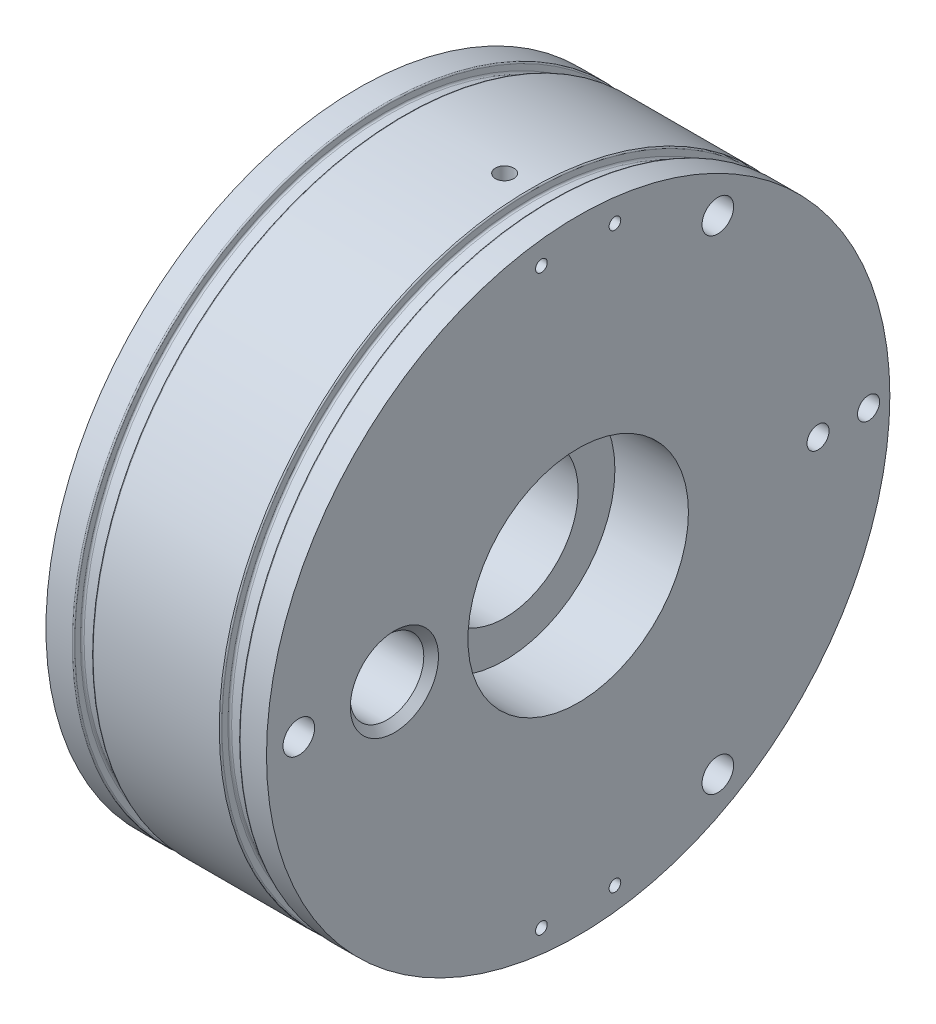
from build123d import *

# Parameters (mm, degrees)
SKETCH1_R                      = 42.4
BOSS_EXTRUDE1_DEPTH            = 30
SKETCH2_R                      = 10
CUT_EXTRUDE1_DEPTH             = 68.048639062
SKETCH3_R                      = 3.1
CUT_EXTRUDE2_DEPTH             = 1.5
F_4_3_4_3_DIAMETER_HOLE1_D     = 4.3
CIRPATTERN1_COUNT              = 3
SKETCH6_R                      = 5
CUT_EXTRUDE3_DEPTH             = 68.048639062
CHAMFER1_SIZE                  = 1
SKETCH7_R                      = 1.5
CUT_EXTRUDE4_DEPTH             = 10
SKETCH8_R                      = 15
CUT_EXTRUDE5_DEPTH             = 10
FILLET1_R                      = 0.1778
CIRPATTERN2_COUNT              = 2
CIRPATTERN2_ANGLE              = 270
F_1_16_0_0625_DIAMETER_HOLE1_D = 1.5875
SKETCH14_R                     = 1.5
CUT_EXTRUDE6_DEPTH             = 3
CIRPATTERN3_COUNT              = 2


with BuildPart() as part:
    # Sketch1 → Boss-Extrude1 (new body)
    with BuildSketch(Plane(origin=(0, 0, 0), x_dir=(0, 0, -1), z_dir=(1, 0, 0))):
        Circle(SKETCH1_R)
    extrude(amount=BOSS_EXTRUDE1_DEPTH)

    # Sketch2 → Cut-Extrude1 (cut, through all)
    with BuildSketch(Plane(origin=(30, 0, 0), x_dir=(0, 0, -1), z_dir=(1, 0, 0))):
        Circle(SKETCH2_R)
    extrude(amount=-CUT_EXTRUDE1_DEPTH, mode=Mode.SUBTRACT)

    # Sketch3 → Cut-Extrude2 (cut)
    with BuildSketch(Plane.ZY):
        with Locations((38, 0)):
            Circle(SKETCH3_R)
    cut_extrude2 = extrude(amount=-CUT_EXTRUDE2_DEPTH, mode=Mode.SUBTRACT)

    # 4.3 _4.3_ Diameter Hole1 (through all)
    with Locations(Plane(origin=(30, 0, 0), x_dir=(0, 0, -1), z_dir=(1, 0, 0))):
        with Locations((-38, 0)):
            f_4_3_4_3_diameter_hole1 = Hole(F_4_3_4_3_DIAMETER_HOLE1_D / 2)

    # CirPattern1: Cut-Extrude2, 4.3 _4.3_ Diameter Hole1 ×3 about axis
    cirpattern1_axis = Axis((0, 0, 0), (1, 0, 0))
    add([cut_extrude2.rotate(cirpattern1_axis, i * 360 / CIRPATTERN1_COUNT) for i in range(1, CIRPATTERN1_COUNT)], mode=Mode.SUBTRACT)
    add([f_4_3_4_3_diameter_hole1.rotate(cirpattern1_axis, i * 360 / CIRPATTERN1_COUNT) for i in range(1, CIRPATTERN1_COUNT)], mode=Mode.SUBTRACT)

    # Sketch6 → Cut-Extrude3 (cut, through all)
    with BuildSketch(Plane(origin=(30, 0, 0), x_dir=(0, 0, -1), z_dir=(1, 0, 0))):
        with Locations((-25, 0)):
            Circle(SKETCH6_R)
    extrude(amount=-CUT_EXTRUDE3_DEPTH, mode=Mode.SUBTRACT)

    # Chamfer1
    chamfer1_edges = [part.edges().sort_by_distance(p)[0] for p in [
        (0, 0, 30),
        (30, 0, 30),
    ]]
    chamfer(chamfer1_edges, length=CHAMFER1_SIZE)

    # Sketch7 → Cut-Extrude4 (cut)
    with BuildSketch(Plane(origin=(30, 0, 0), x_dir=(0, 0, -1), z_dir=(1, 0, 0))):
        with Locations((32.63, 0)):
            Circle(SKETCH7_R)
    extrude(amount=-CUT_EXTRUDE4_DEPTH, mode=Mode.SUBTRACT)

    # Sketch8 → Cut-Extrude5 (cut)
    with BuildSketch(Plane(origin=(30, 0, 0), x_dir=(0, 0, -1), z_dir=(1, 0, 0))):
        Circle(SKETCH8_R)
    extrude(amount=-CUT_EXTRUDE5_DEPTH, mode=Mode.SUBTRACT)

    # Sketch9 → Cut-Revolve1 (revolve, cut)
    with BuildSketch(Plane.XY, mode=Mode.PRIVATE) as cut_revolve1_sk:
        with BuildLine():
            Line((23.7555, 43.6446), (26.2445, 43.6446))
            Line((26.2445, 43.6446), (26.2445, 41.4094))
            ThreePointArc((26.2445, 41.4094), (26.170105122, 41.229794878), (25.9905, 41.1554))
            Line((25.9905, 41.1554), (24.0095, 41.1554))
            ThreePointArc((24.0095, 41.1554), (23.829894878, 41.229794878), (23.7555, 41.4094))
            Line((23.7555, 41.4094), (23.7555, 43.6446))
        make_face()
        with BuildLine():
            Line((3.755596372, 43.706687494), (6.244596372, 43.706687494))
            Line((6.244596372, 43.706687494), (6.244596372, 41.471487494))
            ThreePointArc((6.244596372, 41.471487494), (6.170201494, 41.291882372), (5.990596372, 41.217487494))
            Line((5.990596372, 41.217487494), (4.009596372, 41.217487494))
            ThreePointArc((4.009596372, 41.217487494), (3.829991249, 41.291882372), (3.755596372, 41.471487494))
            Line((3.755596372, 41.471487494), (3.755596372, 43.706687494))
        make_face()
    revolve(cut_revolve1_sk.sketch.rotate(Axis((0, 0, 0), (1, 0, 0)), 90), axis=Axis((0, 0, 0), (1, 0, 0)), mode=Mode.SUBTRACT)

    # Fillet1
    fillet1_edges = [part.edges().sort_by_distance(p)[0] for p in [
        (23.7555, 0, 42.4),
        (26.2445, 0, 42.4),
        (3.755596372, 0, 42.4),
        (6.244596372, 0, 42.4),
    ]]
    fillet(fillet1_edges, radius=FILLET1_R)

    # Sketch10 → M3x0.5 Tapped Hole1 (revolve, cut)
    with BuildSketch(Plane(origin=(20, 42.4, 0), x_dir=(0, 0, 1), z_dir=(1, 0, 0))):
        Polygon((0, 0), (0, 8.251075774), (1.25, 7.5), (1.25, 0), align=None)
    m3x0_5_tapped_hole1 = revolve(axis=Axis((20, 48.75, 0), (0, -1, 0)), mode=Mode.SUBTRACT)

    # CirPattern2: M3x0.5 Tapped Hole1 ×2 about axis
    cirpattern2_axis = Axis((20, 0, 0), (1, 0, 0))
    for i in range(1, CIRPATTERN2_COUNT):
        add(m3x0_5_tapped_hole1.rotate(cirpattern2_axis, i * CIRPATTERN2_ANGLE / (CIRPATTERN2_COUNT - 1)), mode=Mode.SUBTRACT)

    # 1_16 _0.0625_ Diameter Hole1 (through all)
    with Locations(Plane(origin=(30, 0, 0), x_dir=(0, 0, -1), z_dir=(1, 0, 0))):
        with Locations((-5, -39), (5, -39)):
            f_1_16_0_0625_diameter_hole1 = Hole(F_1_16_0_0625_DIAMETER_HOLE1_D / 2)

    # Sketch14 → Cut-Extrude6 (cut)
    with BuildSketch(Plane(origin=(30, 0, 0), x_dir=(0, 0, -1), z_dir=(1, 0, 0))):
        with Locations((39.5, 0)):
            Circle(SKETCH14_R)
    extrude(amount=-CUT_EXTRUDE6_DEPTH, mode=Mode.SUBTRACT)

    # CirPattern3: 1_16 _0.0625_ Diameter Hole1 ×2 about axis
    cirpattern3_axis = Axis((0, 0, 0), (1, 0, 0))
    for i in range(1, CIRPATTERN3_COUNT):
        add(f_1_16_0_0625_diameter_hole1.rotate(cirpattern3_axis, i * 360 / CIRPATTERN3_COUNT), mode=Mode.SUBTRACT)


solid = part.part
